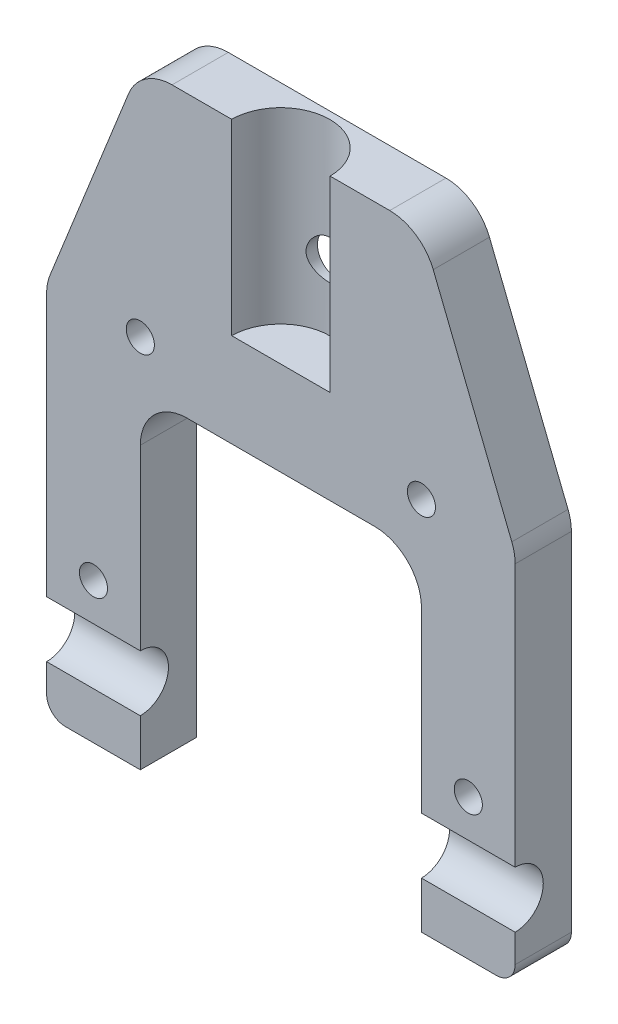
ISO-10303-21;
HEADER;
FILE_DESCRIPTION(('STEP AP214'),'2;1');
FILE_NAME('part.step','',(''),(''),'','','');
FILE_SCHEMA(('AUTOMOTIVE_DESIGN { 1 0 10303 214 1 1 1 1 }'));
ENDSEC;
DATA;
#1=APPLICATION_CONTEXT('core data for automotive mechanical design processes');
#2=APPLICATION_PROTOCOL_DEFINITION('international standard','automotive_design',2000,#1);
#3=PRODUCT_CONTEXT('',#1,'mechanical');
#4=PRODUCT('Part','Part','',(#3));
#5=PRODUCT_RELATED_PRODUCT_CATEGORY('part','',(#4));
#6=PRODUCT_DEFINITION_FORMATION('','',#4);
#7=PRODUCT_DEFINITION_CONTEXT('part definition',#1,'design');
#8=PRODUCT_DEFINITION('design','',#6,#7);
#9=PRODUCT_DEFINITION_SHAPE('','',#8);
#10=(LENGTH_UNIT() NAMED_UNIT(*) SI_UNIT(.MILLI.,.METRE.));
#11=(NAMED_UNIT(*) PLANE_ANGLE_UNIT() SI_UNIT($,.RADIAN.));
#12=(NAMED_UNIT(*) SI_UNIT($,.STERADIAN.) SOLID_ANGLE_UNIT());
#13=UNCERTAINTY_MEASURE_WITH_UNIT(LENGTH_MEASURE(1.E-05),#10,'distance_accuracy_value','');
#14=(GEOMETRIC_REPRESENTATION_CONTEXT(3) GLOBAL_UNCERTAINTY_ASSIGNED_CONTEXT((#13)) GLOBAL_UNIT_ASSIGNED_CONTEXT((#10,
#11,#12)) REPRESENTATION_CONTEXT('',''));
#15=CARTESIAN_POINT('',(0.,0.,0.));
#16=DIRECTION('',(0.,0.,1.));
#17=DIRECTION('',(1.,0.,0.));
#18=AXIS2_PLACEMENT_3D('',#15,#16,#17);
#19=CARTESIAN_POINT('',(5.,39.0370879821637,6.));
#20=DIRECTION('',(0.,0.,-1.));
#21=DIRECTION('',(-1.,0.,0.));
#22=AXIS2_PLACEMENT_3D('',#19,#20,#21);
#23=PLANE('',#22);
#24=CARTESIAN_POINT('',(45.,15.,6.));
#25=DIRECTION('',(0.,0.,1.));
#26=DIRECTION('',(1.,0.,0.));
#27=AXIS2_PLACEMENT_3D('',#24,#25,#26);
#28=CIRCLE('',#27,1.5);
#29=CARTESIAN_POINT('',(46.5,15.,6.));
#30=VERTEX_POINT('',#29);
#31=EDGE_CURVE('E386',#30,#30,#28,.T.);
#32=ORIENTED_EDGE('',*,*,#31,.F.);
#33=EDGE_LOOP('',(#32));
#34=FACE_BOUND('',#33,.T.);
#35=CARTESIAN_POINT('',(40.,40.,6.));
#36=DIRECTION('',(0.,0.,1.));
#37=DIRECTION('',(1.,0.,0.));
#38=AXIS2_PLACEMENT_3D('',#35,#36,#37);
#39=CIRCLE('',#38,1.5);
#40=CARTESIAN_POINT('',(41.5,40.,6.));
#41=VERTEX_POINT('',#40);
#42=EDGE_CURVE('E398',#41,#41,#39,.T.);
#43=ORIENTED_EDGE('',*,*,#42,.F.);
#44=EDGE_LOOP('',(#43));
#45=FACE_BOUND('',#44,.T.);
#46=CARTESIAN_POINT('',(10.,40.,6.));
#47=DIRECTION('',(0.,0.,1.));
#48=DIRECTION('',(1.,0.,0.));
#49=AXIS2_PLACEMENT_3D('',#46,#47,#48);
#50=CIRCLE('',#49,1.5);
#51=CARTESIAN_POINT('',(11.5,40.,6.));
#52=VERTEX_POINT('',#51);
#53=EDGE_CURVE('E404',#52,#52,#50,.T.);
#54=ORIENTED_EDGE('',*,*,#53,.F.);
#55=EDGE_LOOP('',(#54));
#56=FACE_BOUND('',#55,.T.);
#57=CARTESIAN_POINT('',(5.,15.,6.));
#58=DIRECTION('',(0.,0.,1.));
#59=DIRECTION('',(1.,0.,0.));
#60=AXIS2_PLACEMENT_3D('',#57,#58,#59);
#61=CIRCLE('',#60,1.5);
#62=CARTESIAN_POINT('',(6.5,15.,6.));
#63=VERTEX_POINT('',#62);
#64=EDGE_CURVE('E392',#63,#63,#61,.T.);
#65=ORIENTED_EDGE('',*,*,#64,.F.);
#66=EDGE_LOOP('',(#65));
#67=FACE_BOUND('',#66,.T.);
#68=DIRECTION('',(0.,-1.,0.));
#69=VECTOR('',#68,1.);
#70=CARTESIAN_POINT('',(0.,2.00000000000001,6.));
#71=LINE('',#70,#69);
#72=CARTESIAN_POINT('',(0.,39.0370879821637,6.));
#73=VERTEX_POINT('',#72);
#74=CARTESIAN_POINT('',(0.,11.,6.));
#75=VERTEX_POINT('',#74);
#76=EDGE_CURVE('E198',#73,#75,#71,.T.);
#77=ORIENTED_EDGE('',*,*,#76,.T.);
#78=DIRECTION('',(1.,0.,0.));
#79=VECTOR('',#78,1.);
#80=CARTESIAN_POINT('',(0.,11.,6.));
#81=LINE('',#80,#79);
#82=CARTESIAN_POINT('',(10.,11.,6.));
#83=VERTEX_POINT('',#82);
#84=EDGE_CURVE('E184',#75,#83,#81,.T.);
#85=ORIENTED_EDGE('',*,*,#84,.T.);
#86=DIRECTION('',(0.,-1.,0.));
#87=VECTOR('',#86,1.);
#88=CARTESIAN_POINT('',(10.,30.,6.));
#89=LINE('',#88,#87);
#90=CARTESIAN_POINT('',(10.,30.,6.));
#91=VERTEX_POINT('',#90);
#92=EDGE_CURVE('E350',#91,#83,#89,.T.);
#93=ORIENTED_EDGE('',*,*,#92,.F.);
#94=CARTESIAN_POINT('',(15.,30.,6.));
#95=DIRECTION('',(0.,0.,1.));
#96=DIRECTION('',(1.,0.,0.));
#97=AXIS2_PLACEMENT_3D('',#94,#95,#96);
#98=CIRCLE('',#97,5.);
#99=CARTESIAN_POINT('',(15.,35.,6.));
#100=VERTEX_POINT('',#99);
#101=EDGE_CURVE('E351',#100,#91,#98,.T.);
#102=ORIENTED_EDGE('',*,*,#101,.F.);
#103=DIRECTION('',(-1.,0.,0.));
#104=VECTOR('',#103,1.);
#105=CARTESIAN_POINT('',(15.,35.,6.));
#106=LINE('',#105,#104);
#107=CARTESIAN_POINT('',(35.,35.,6.));
#108=VERTEX_POINT('',#107);
#109=EDGE_CURVE('E355',#108,#100,#106,.T.);
#110=ORIENTED_EDGE('',*,*,#109,.F.);
#111=CARTESIAN_POINT('',(35.,30.,6.));
#112=DIRECTION('',(0.,0.,1.));
#113=DIRECTION('',(-1.,0.,0.));
#114=AXIS2_PLACEMENT_3D('',#111,#112,#113);
#115=CIRCLE('',#114,5.);
#116=CARTESIAN_POINT('',(40.,30.,6.));
#117=VERTEX_POINT('',#116);
#118=EDGE_CURVE('E477',#117,#108,#115,.T.);
#119=ORIENTED_EDGE('',*,*,#118,.F.);
#120=DIRECTION('',(0.,1.,0.));
#121=VECTOR('',#120,1.);
#122=CARTESIAN_POINT('',(40.,30.,6.));
#123=LINE('',#122,#121);
#124=CARTESIAN_POINT('',(40.,11.,6.));
#125=VERTEX_POINT('',#124);
#126=EDGE_CURVE('E474',#125,#117,#123,.T.);
#127=ORIENTED_EDGE('',*,*,#126,.F.);
#128=CARTESIAN_POINT('',(50.,11.,6.));
#129=VERTEX_POINT('',#128);
#130=EDGE_CURVE('E41',#125,#129,#81,.T.);
#131=ORIENTED_EDGE('',*,*,#130,.T.);
#132=DIRECTION('',(0.,1.,0.));
#133=VECTOR('',#132,1.);
#134=CARTESIAN_POINT('',(50.,39.0370879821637,6.));
#135=LINE('',#134,#133);
#136=CARTESIAN_POINT('',(50.,39.0370879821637,6.));
#137=VERTEX_POINT('',#136);
#138=EDGE_CURVE('E219',#129,#137,#135,.T.);
#139=ORIENTED_EDGE('',*,*,#138,.T.);
#140=CARTESIAN_POINT('',(45.,39.0370879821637,6.));
#141=DIRECTION('',(0.,0.,1.));
#142=DIRECTION('',(-1.,0.,0.));
#143=AXIS2_PLACEMENT_3D('',#140,#141,#142);
#144=CIRCLE('',#143,5.);
#145=CARTESIAN_POINT('',(49.6423834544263,40.8940413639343,6.));
#146=VERTEX_POINT('',#145);
#147=EDGE_CURVE('E223',#137,#146,#144,.T.);
#148=ORIENTED_EDGE('',*,*,#147,.T.);
#149=DIRECTION('',(-0.371390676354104,0.928476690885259,0.));
#150=VECTOR('',#149,1.);
#151=CARTESIAN_POINT('',(41.2572186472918,61.8569533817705,6.));
#152=LINE('',#151,#150);
#153=CARTESIAN_POINT('',(41.2572186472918,61.8569533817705,6.));
#154=VERTEX_POINT('',#153);
#155=EDGE_CURVE('E225',#146,#154,#152,.T.);
#156=ORIENTED_EDGE('',*,*,#155,.T.);
#157=CARTESIAN_POINT('',(36.6148351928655,60.,6.));
#158=DIRECTION('',(0.,0.,1.));
#159=DIRECTION('',(-1.,0.,0.));
#160=AXIS2_PLACEMENT_3D('',#157,#158,#159);
#161=CIRCLE('',#160,5.);
#162=CARTESIAN_POINT('',(36.6148351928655,65.,6.));
#163=VERTEX_POINT('',#162);
#164=EDGE_CURVE('E227',#154,#163,#161,.T.);
#165=ORIENTED_EDGE('',*,*,#164,.T.);
#166=DIRECTION('',(-1.,0.,0.));
#167=VECTOR('',#166,1.);
#168=CARTESIAN_POINT('',(13.3851648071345,65.,6.));
#169=LINE('',#168,#167);
#170=CARTESIAN_POINT('',(30.2499348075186,65.,6.));
#171=VERTEX_POINT('',#170);
#172=EDGE_CURVE('E230',#163,#171,#169,.T.);
#173=ORIENTED_EDGE('',*,*,#172,.T.);
#174=DIRECTION('',(0.,1.,0.));
#175=VECTOR('',#174,1.);
#176=CARTESIAN_POINT('',(30.2499348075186,45.,6.));
#177=LINE('',#176,#175);
#178=CARTESIAN_POINT('',(30.2499348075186,45.,6.));
#179=VERTEX_POINT('',#178);
#180=EDGE_CURVE('E280',#171,#179,#177,.F.);
#181=ORIENTED_EDGE('',*,*,#180,.T.);
#182=DIRECTION('',(1.,0.,0.));
#183=VECTOR('',#182,1.);
#184=CARTESIAN_POINT('',(5.,45.,6.));
#185=LINE('',#184,#183);
#186=CARTESIAN_POINT('',(19.7500651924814,45.,6.));
#187=VERTEX_POINT('',#186);
#188=EDGE_CURVE('E272',#187,#179,#185,.T.);
#189=ORIENTED_EDGE('',*,*,#188,.F.);
#190=DIRECTION('',(0.,1.,0.));
#191=VECTOR('',#190,1.);
#192=CARTESIAN_POINT('',(19.7500651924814,45.,6.));
#193=LINE('',#192,#191);
#194=CARTESIAN_POINT('',(19.7500651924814,65.,6.));
#195=VERTEX_POINT('',#194);
#196=EDGE_CURVE('E377',#187,#195,#193,.T.);
#197=ORIENTED_EDGE('',*,*,#196,.T.);
#198=CARTESIAN_POINT('',(13.3851648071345,65.,6.));
#199=VERTEX_POINT('',#198);
#200=EDGE_CURVE('E229',#195,#199,#169,.T.);
#201=ORIENTED_EDGE('',*,*,#200,.T.);
#202=CARTESIAN_POINT('',(13.3851648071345,60.,6.));
#203=DIRECTION('',(0.,0.,1.));
#204=DIRECTION('',(-1.,0.,0.));
#205=AXIS2_PLACEMENT_3D('',#202,#203,#204);
#206=CIRCLE('',#205,5.);
#207=CARTESIAN_POINT('',(8.7427813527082,61.8569533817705,6.));
#208=VERTEX_POINT('',#207);
#209=EDGE_CURVE('E233',#199,#208,#206,.T.);
#210=ORIENTED_EDGE('',*,*,#209,.T.);
#211=DIRECTION('',(-0.371390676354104,-0.928476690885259,0.));
#212=VECTOR('',#211,1.);
#213=CARTESIAN_POINT('',(0.35761654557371,40.8940413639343,6.));
#214=LINE('',#213,#212);
#215=CARTESIAN_POINT('',(0.35761654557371,40.8940413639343,6.));
#216=VERTEX_POINT('',#215);
#217=EDGE_CURVE('E235',#208,#216,#214,.T.);
#218=ORIENTED_EDGE('',*,*,#217,.T.);
#219=CARTESIAN_POINT('',(5.,39.0370879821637,6.));
#220=DIRECTION('',(0.,0.,1.));
#221=DIRECTION('',(-1.,0.,0.));
#222=AXIS2_PLACEMENT_3D('',#219,#220,#221);
#223=CIRCLE('',#222,5.);
#224=EDGE_CURVE('E205',#216,#73,#223,.T.);
#225=ORIENTED_EDGE('',*,*,#224,.T.);
#226=EDGE_LOOP('',(#77,#85,#93,#102,#110,#119,#127,#131,#139,#148,#156,#165,#173,#181,#189,#197,
#201,#210,#218,#225));
#227=FACE_BOUND('',#226,.T.);
#228=ADVANCED_FACE('F26',(#34,#45,#56,#67,#227),#23,.F.);
#229=CARTESIAN_POINT('',(50.,2.00000000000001,6.));
#230=VERTEX_POINT('',#229);
#231=CARTESIAN_POINT('',(50.,5.,6.));
#232=VERTEX_POINT('',#231);
#233=EDGE_CURVE('E220',#230,#232,#135,.T.);
#234=ORIENTED_EDGE('',*,*,#233,.T.);
#235=DIRECTION('',(1.,0.,0.));
#236=VECTOR('',#235,1.);
#237=CARTESIAN_POINT('',(0.,5.,6.));
#238=LINE('',#237,#236);
#239=CARTESIAN_POINT('',(40.,5.,6.));
#240=VERTEX_POINT('',#239);
#241=EDGE_CURVE('E478',#232,#240,#238,.F.);
#242=ORIENTED_EDGE('',*,*,#241,.T.);
#243=CARTESIAN_POINT('',(40.,0.,6.));
#244=VERTEX_POINT('',#243);
#245=EDGE_CURVE('E475',#244,#240,#123,.T.);
#246=ORIENTED_EDGE('',*,*,#245,.F.);
#247=DIRECTION('',(1.,0.,0.));
#248=VECTOR('',#247,1.);
#249=CARTESIAN_POINT('',(48.,0.,6.));
#250=LINE('',#249,#248);
#251=CARTESIAN_POINT('',(48.,0.,6.));
#252=VERTEX_POINT('',#251);
#253=EDGE_CURVE('E209',#244,#252,#250,.T.);
#254=ORIENTED_EDGE('',*,*,#253,.T.);
#255=CARTESIAN_POINT('',(48.,2.,6.));
#256=DIRECTION('',(0.,0.,1.));
#257=DIRECTION('',(-1.,0.,0.));
#258=AXIS2_PLACEMENT_3D('',#255,#256,#257);
#259=CIRCLE('',#258,2.);
#260=EDGE_CURVE('E217',#252,#230,#259,.T.);
#261=ORIENTED_EDGE('',*,*,#260,.T.);
#262=EDGE_LOOP('',(#234,#242,#246,#254,#261));
#263=FACE_BOUND('',#262,.T.);
#264=ADVANCED_FACE('F321',(#263),#23,.F.);
#265=CARTESIAN_POINT('',(48.,0.,6.));
#266=DIRECTION('',(0.,1.,0.));
#267=DIRECTION('',(0.,0.,1.));
#268=AXIS2_PLACEMENT_3D('',#265,#266,#267);
#269=PLANE('',#268);
#270=ORIENTED_EDGE('',*,*,#253,.F.);
#271=DIRECTION('',(0.,0.,-1.));
#272=VECTOR('',#271,1.);
#273=CARTESIAN_POINT('',(40.,0.,6.));
#274=LINE('',#273,#272);
#275=CARTESIAN_POINT('',(40.,0.,0.));
#276=VERTEX_POINT('',#275);
#277=EDGE_CURVE('E452',#244,#276,#274,.T.);
#278=ORIENTED_EDGE('',*,*,#277,.T.);
#279=DIRECTION('',(1.,0.,0.));
#280=VECTOR('',#279,1.);
#281=CARTESIAN_POINT('',(48.,0.,0.));
#282=LINE('',#281,#280);
#283=CARTESIAN_POINT('',(48.,0.,0.));
#284=VERTEX_POINT('',#283);
#285=EDGE_CURVE('E414',#276,#284,#282,.T.);
#286=ORIENTED_EDGE('',*,*,#285,.T.);
#287=DIRECTION('',(0.,0.,-1.));
#288=VECTOR('',#287,1.);
#289=CARTESIAN_POINT('',(48.,0.,6.));
#290=LINE('',#289,#288);
#291=EDGE_CURVE('E261',#252,#284,#290,.T.);
#292=ORIENTED_EDGE('',*,*,#291,.F.);
#293=EDGE_LOOP('',(#270,#278,#286,#292));
#294=FACE_BOUND('',#293,.T.);
#295=ADVANCED_FACE('F328',(#294),#269,.F.);
#296=CARTESIAN_POINT('',(10.,5.,6.));
#297=VERTEX_POINT('',#296);
#298=CARTESIAN_POINT('',(10.,0.,6.));
#299=VERTEX_POINT('',#298);
#300=EDGE_CURVE('E347',#297,#299,#89,.T.);
#301=ORIENTED_EDGE('',*,*,#300,.F.);
#302=CARTESIAN_POINT('',(0.,5.,6.));
#303=VERTEX_POINT('',#302);
#304=EDGE_CURVE('E49',#297,#303,#238,.F.);
#305=ORIENTED_EDGE('',*,*,#304,.T.);
#306=CARTESIAN_POINT('',(0.,2.00000000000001,6.));
#307=VERTEX_POINT('',#306);
#308=EDGE_CURVE('E201',#303,#307,#71,.T.);
#309=ORIENTED_EDGE('',*,*,#308,.T.);
#310=CARTESIAN_POINT('',(2.,2.,6.));
#311=DIRECTION('',(0.,0.,1.));
#312=DIRECTION('',(1.,0.,0.));
#313=AXIS2_PLACEMENT_3D('',#310,#311,#312);
#314=CIRCLE('',#313,2.);
#315=CARTESIAN_POINT('',(2.00000000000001,0.,6.));
#316=VERTEX_POINT('',#315);
#317=EDGE_CURVE('E207',#307,#316,#314,.T.);
#318=ORIENTED_EDGE('',*,*,#317,.T.);
#319=EDGE_CURVE('E214',#316,#299,#250,.T.);
#320=ORIENTED_EDGE('',*,*,#319,.T.);
#321=EDGE_LOOP('',(#301,#305,#309,#318,#320));
#322=FACE_BOUND('',#321,.T.);
#323=ADVANCED_FACE('F324',(#322),#23,.F.);
#324=CARTESIAN_POINT('',(5.,39.0370879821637,0.));
#325=DIRECTION('',(0.,0.,-1.));
#326=DIRECTION('',(-1.,0.,0.));
#327=AXIS2_PLACEMENT_3D('',#324,#325,#326);
#328=PLANE('',#327);
#329=DIRECTION('',(0.,-1.,0.));
#330=VECTOR('',#329,1.);
#331=CARTESIAN_POINT('',(40.,39.0370879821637,0.));
#332=LINE('',#331,#330);
#333=CARTESIAN_POINT('',(40.,30.,0.));
#334=VERTEX_POINT('',#333);
#335=EDGE_CURVE('E369',#334,#276,#332,.T.);
#336=ORIENTED_EDGE('',*,*,#335,.F.);
#337=CARTESIAN_POINT('',(35.,30.,0.));
#338=DIRECTION('',(0.,0.,-1.));
#339=DIRECTION('',(-1.,0.,0.));
#340=AXIS2_PLACEMENT_3D('',#337,#338,#339);
#341=CIRCLE('',#340,5.);
#342=CARTESIAN_POINT('',(35.,35.,0.));
#343=VERTEX_POINT('',#342);
#344=EDGE_CURVE('E454',#343,#334,#341,.T.);
#345=ORIENTED_EDGE('',*,*,#344,.F.);
#346=DIRECTION('',(1.,0.,0.));
#347=VECTOR('',#346,1.);
#348=CARTESIAN_POINT('',(5.,35.,0.));
#349=LINE('',#348,#347);
#350=CARTESIAN_POINT('',(15.,35.,0.));
#351=VERTEX_POINT('',#350);
#352=EDGE_CURVE('E458',#351,#343,#349,.T.);
#353=ORIENTED_EDGE('',*,*,#352,.F.);
#354=CARTESIAN_POINT('',(15.,30.,0.));
#355=DIRECTION('',(0.,0.,-1.));
#356=DIRECTION('',(-1.,0.,0.));
#357=AXIS2_PLACEMENT_3D('',#354,#355,#356);
#358=CIRCLE('',#357,5.);
#359=CARTESIAN_POINT('',(10.,30.,0.));
#360=VERTEX_POINT('',#359);
#361=EDGE_CURVE('E34',#360,#351,#358,.T.);
#362=ORIENTED_EDGE('',*,*,#361,.F.);
#363=DIRECTION('',(0.,1.,0.));
#364=VECTOR('',#363,1.);
#365=CARTESIAN_POINT('',(10.,39.0370879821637,0.));
#366=LINE('',#365,#364);
#367=CARTESIAN_POINT('',(10.,0.,0.));
#368=VERTEX_POINT('',#367);
#369=EDGE_CURVE('E361',#368,#360,#366,.T.);
#370=ORIENTED_EDGE('',*,*,#369,.F.);
#371=CARTESIAN_POINT('',(2.00000000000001,0.,0.));
#372=VERTEX_POINT('',#371);
#373=EDGE_CURVE('E415',#372,#368,#282,.T.);
#374=ORIENTED_EDGE('',*,*,#373,.F.);
#375=CARTESIAN_POINT('',(2.,2.,0.));
#376=DIRECTION('',(0.,0.,1.));
#377=DIRECTION('',(1.,0.,0.));
#378=AXIS2_PLACEMENT_3D('',#375,#376,#377);
#379=CIRCLE('',#378,2.);
#380=CARTESIAN_POINT('',(0.,2.00000000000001,0.));
#381=VERTEX_POINT('',#380);
#382=EDGE_CURVE('E412',#381,#372,#379,.T.);
#383=ORIENTED_EDGE('',*,*,#382,.F.);
#384=DIRECTION('',(0.,-1.,0.));
#385=VECTOR('',#384,1.);
#386=CARTESIAN_POINT('',(0.,2.00000000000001,0.));
#387=LINE('',#386,#385);
#388=CARTESIAN_POINT('',(0.,39.0370879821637,0.));
#389=VERTEX_POINT('',#388);
#390=EDGE_CURVE('E410',#389,#381,#387,.T.);
#391=ORIENTED_EDGE('',*,*,#390,.F.);
#392=CARTESIAN_POINT('',(5.,39.0370879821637,0.));
#393=DIRECTION('',(0.,0.,1.));
#394=DIRECTION('',(-1.,0.,0.));
#395=AXIS2_PLACEMENT_3D('',#392,#393,#394);
#396=CIRCLE('',#395,5.);
#397=CARTESIAN_POINT('',(0.35761654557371,40.8940413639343,0.));
#398=VERTEX_POINT('',#397);
#399=EDGE_CURVE('E407',#398,#389,#396,.T.);
#400=ORIENTED_EDGE('',*,*,#399,.F.);
#401=DIRECTION('',(-0.371390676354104,-0.928476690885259,0.));
#402=VECTOR('',#401,1.);
#403=CARTESIAN_POINT('',(0.35761654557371,40.8940413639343,0.));
#404=LINE('',#403,#402);
#405=CARTESIAN_POINT('',(8.7427813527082,61.8569533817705,0.));
#406=VERTEX_POINT('',#405);
#407=EDGE_CURVE('E431',#406,#398,#404,.T.);
#408=ORIENTED_EDGE('',*,*,#407,.F.);
#409=CARTESIAN_POINT('',(13.3851648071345,60.,0.));
#410=DIRECTION('',(0.,0.,1.));
#411=DIRECTION('',(-1.,0.,0.));
#412=AXIS2_PLACEMENT_3D('',#409,#410,#411);
#413=CIRCLE('',#412,5.);
#414=CARTESIAN_POINT('',(13.3851648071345,65.,0.));
#415=VERTEX_POINT('',#414);
#416=EDGE_CURVE('E430',#415,#406,#413,.T.);
#417=ORIENTED_EDGE('',*,*,#416,.F.);
#418=DIRECTION('',(-1.,0.,0.));
#419=VECTOR('',#418,1.);
#420=CARTESIAN_POINT('',(13.3851648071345,65.,0.));
#421=LINE('',#420,#419);
#422=CARTESIAN_POINT('',(36.6148351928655,65.,0.));
#423=VERTEX_POINT('',#422);
#424=EDGE_CURVE('E428',#423,#415,#421,.T.);
#425=ORIENTED_EDGE('',*,*,#424,.F.);
#426=CARTESIAN_POINT('',(36.6148351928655,60.,0.));
#427=DIRECTION('',(0.,0.,1.));
#428=DIRECTION('',(-1.,0.,0.));
#429=AXIS2_PLACEMENT_3D('',#426,#427,#428);
#430=CIRCLE('',#429,5.);
#431=CARTESIAN_POINT('',(41.2572186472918,61.8569533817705,0.));
#432=VERTEX_POINT('',#431);
#433=EDGE_CURVE('E426',#432,#423,#430,.T.);
#434=ORIENTED_EDGE('',*,*,#433,.F.);
#435=DIRECTION('',(-0.371390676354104,0.928476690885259,0.));
#436=VECTOR('',#435,1.);
#437=CARTESIAN_POINT('',(41.2572186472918,61.8569533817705,0.));
#438=LINE('',#437,#436);
#439=CARTESIAN_POINT('',(49.6423834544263,40.8940413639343,0.));
#440=VERTEX_POINT('',#439);
#441=EDGE_CURVE('E424',#440,#432,#438,.T.);
#442=ORIENTED_EDGE('',*,*,#441,.F.);
#443=CARTESIAN_POINT('',(45.,39.0370879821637,0.));
#444=DIRECTION('',(0.,0.,1.));
#445=DIRECTION('',(-1.,0.,0.));
#446=AXIS2_PLACEMENT_3D('',#443,#444,#445);
#447=CIRCLE('',#446,5.);
#448=CARTESIAN_POINT('',(50.,39.0370879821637,0.));
#449=VERTEX_POINT('',#448);
#450=EDGE_CURVE('E422',#449,#440,#447,.T.);
#451=ORIENTED_EDGE('',*,*,#450,.F.);
#452=DIRECTION('',(0.,1.,0.));
#453=VECTOR('',#452,1.);
#454=CARTESIAN_POINT('',(50.,39.0370879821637,0.));
#455=LINE('',#454,#453);
#456=CARTESIAN_POINT('',(50.,2.00000000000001,0.));
#457=VERTEX_POINT('',#456);
#458=EDGE_CURVE('E420',#457,#449,#455,.T.);
#459=ORIENTED_EDGE('',*,*,#458,.F.);
#460=CARTESIAN_POINT('',(48.,2.,0.));
#461=DIRECTION('',(0.,0.,1.));
#462=DIRECTION('',(-1.,0.,0.));
#463=AXIS2_PLACEMENT_3D('',#460,#461,#462);
#464=CIRCLE('',#463,2.);
#465=EDGE_CURVE('E418',#284,#457,#464,.T.);
#466=ORIENTED_EDGE('',*,*,#465,.F.);
#467=ORIENTED_EDGE('',*,*,#285,.F.);
#468=EDGE_LOOP('',(#336,#345,#353,#362,#370,#374,#383,#391,#400,#408,#417,#425,#434,#442,#451,
#459,#466,#467));
#469=FACE_BOUND('',#468,.T.);
#470=CARTESIAN_POINT('',(45.,15.,0.));
#471=DIRECTION('',(0.,0.,1.));
#472=DIRECTION('',(1.,0.,0.));
#473=AXIS2_PLACEMENT_3D('',#470,#471,#472);
#474=CIRCLE('',#473,1.5);
#475=CARTESIAN_POINT('',(46.5,15.,0.));
#476=VERTEX_POINT('',#475);
#477=EDGE_CURVE('E383',#476,#476,#474,.T.);
#478=ORIENTED_EDGE('',*,*,#477,.T.);
#479=EDGE_LOOP('',(#478));
#480=FACE_BOUND('',#479,.T.);
#481=CARTESIAN_POINT('',(40.,40.,0.));
#482=DIRECTION('',(0.,0.,1.));
#483=DIRECTION('',(1.,0.,0.));
#484=AXIS2_PLACEMENT_3D('',#481,#482,#483);
#485=CIRCLE('',#484,1.5);
#486=CARTESIAN_POINT('',(41.5,40.,0.));
#487=VERTEX_POINT('',#486);
#488=EDGE_CURVE('E395',#487,#487,#485,.T.);
#489=ORIENTED_EDGE('',*,*,#488,.T.);
#490=EDGE_LOOP('',(#489));
#491=FACE_BOUND('',#490,.T.);
#492=CARTESIAN_POINT('',(10.,40.,0.));
#493=DIRECTION('',(0.,0.,1.));
#494=DIRECTION('',(1.,0.,0.));
#495=AXIS2_PLACEMENT_3D('',#492,#493,#494);
#496=CIRCLE('',#495,1.5);
#497=CARTESIAN_POINT('',(11.5,40.,0.));
#498=VERTEX_POINT('',#497);
#499=EDGE_CURVE('E401',#498,#498,#496,.T.);
#500=ORIENTED_EDGE('',*,*,#499,.T.);
#501=EDGE_LOOP('',(#500));
#502=FACE_BOUND('',#501,.T.);
#503=CARTESIAN_POINT('',(5.,15.,0.));
#504=DIRECTION('',(0.,0.,1.));
#505=DIRECTION('',(1.,0.,0.));
#506=AXIS2_PLACEMENT_3D('',#503,#504,#505);
#507=CIRCLE('',#506,1.5);
#508=CARTESIAN_POINT('',(6.5,15.,0.));
#509=VERTEX_POINT('',#508);
#510=EDGE_CURVE('E389',#509,#509,#507,.T.);
#511=ORIENTED_EDGE('',*,*,#510,.T.);
#512=EDGE_LOOP('',(#511));
#513=FACE_BOUND('',#512,.T.);
#514=CARTESIAN_POINT('',(25.,52.,0.));
#515=DIRECTION('',(0.,0.,1.));
#516=DIRECTION('',(1.,0.,0.));
#517=AXIS2_PLACEMENT_3D('',#514,#515,#516);
#518=CIRCLE('',#517,2.1);
#519=CARTESIAN_POINT('',(27.1,52.,0.));
#520=VERTEX_POINT('',#519);
#521=EDGE_CURVE('E380',#520,#520,#518,.T.);
#522=ORIENTED_EDGE('',*,*,#521,.T.);
#523=EDGE_LOOP('',(#522));
#524=FACE_BOUND('',#523,.T.);
#525=ADVANCED_FACE('F335',(#469,#480,#491,#502,#513,#524),#328,.T.);
#526=CARTESIAN_POINT('',(5.,39.0370879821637,6.));
#527=DIRECTION('',(0.,0.,-1.));
#528=DIRECTION('',(-1.,0.,0.));
#529=AXIS2_PLACEMENT_3D('',#526,#527,#528);
#530=CYLINDRICAL_SURFACE('',#529,5.);
#531=ORIENTED_EDGE('',*,*,#399,.T.);
#532=DIRECTION('',(0.,0.,-1.));
#533=VECTOR('',#532,1.);
#534=CARTESIAN_POINT('',(0.,39.0370879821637,6.));
#535=LINE('',#534,#533);
#536=EDGE_CURVE('E270',#73,#389,#535,.T.);
#537=ORIENTED_EDGE('',*,*,#536,.F.);
#538=ORIENTED_EDGE('',*,*,#224,.F.);
#539=DIRECTION('',(0.,0.,-1.));
#540=VECTOR('',#539,1.);
#541=CARTESIAN_POINT('',(0.35761654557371,40.8940413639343,6.));
#542=LINE('',#541,#540);
#543=EDGE_CURVE('E237',#216,#398,#542,.T.);
#544=ORIENTED_EDGE('',*,*,#543,.T.);
#545=EDGE_LOOP('',(#531,#537,#538,#544));
#546=FACE_BOUND('',#545,.T.);
#547=ADVANCED_FACE('F28',(#546),#530,.T.);
#548=CARTESIAN_POINT('',(0.,2.00000000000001,6.));
#549=DIRECTION('',(1.,0.,0.));
#550=DIRECTION('',(0.,0.,-1.));
#551=AXIS2_PLACEMENT_3D('',#548,#549,#550);
#552=PLANE('',#551);
#553=ORIENTED_EDGE('',*,*,#308,.F.);
#554=CARTESIAN_POINT('',(0.,8.,6.));
#555=DIRECTION('',(1.,0.,0.));
#556=DIRECTION('',(0.,0.,-1.));
#557=AXIS2_PLACEMENT_3D('',#554,#555,#556);
#558=CIRCLE('',#557,3.);
#559=EDGE_CURVE('E187',#303,#75,#558,.T.);
#560=ORIENTED_EDGE('',*,*,#559,.T.);
#561=ORIENTED_EDGE('',*,*,#76,.F.);
#562=ORIENTED_EDGE('',*,*,#536,.T.);
#563=ORIENTED_EDGE('',*,*,#390,.T.);
#564=DIRECTION('',(0.,0.,-1.));
#565=VECTOR('',#564,1.);
#566=CARTESIAN_POINT('',(0.,2.00000000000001,6.));
#567=LINE('',#566,#565);
#568=EDGE_CURVE('E267',#307,#381,#567,.T.);
#569=ORIENTED_EDGE('',*,*,#568,.F.);
#570=EDGE_LOOP('',(#553,#560,#561,#562,#563,#569));
#571=FACE_BOUND('',#570,.T.);
#572=ADVANCED_FACE('F196',(#571),#552,.F.);
#573=CARTESIAN_POINT('',(2.,2.,6.));
#574=DIRECTION('',(0.,0.,-1.));
#575=DIRECTION('',(-1.,0.,0.));
#576=AXIS2_PLACEMENT_3D('',#573,#574,#575);
#577=CYLINDRICAL_SURFACE('',#576,2.);
#578=ORIENTED_EDGE('',*,*,#382,.T.);
#579=DIRECTION('',(0.,0.,-1.));
#580=VECTOR('',#579,1.);
#581=CARTESIAN_POINT('',(2.00000000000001,0.,6.));
#582=LINE('',#581,#580);
#583=EDGE_CURVE('E264',#316,#372,#582,.T.);
#584=ORIENTED_EDGE('',*,*,#583,.F.);
#585=ORIENTED_EDGE('',*,*,#317,.F.);
#586=ORIENTED_EDGE('',*,*,#568,.T.);
#587=EDGE_LOOP('',(#578,#584,#585,#586));
#588=FACE_BOUND('',#587,.T.);
#589=ADVANCED_FACE('F447',(#588),#577,.T.);
#590=ORIENTED_EDGE('',*,*,#373,.T.);
#591=DIRECTION('',(0.,0.,1.));
#592=VECTOR('',#591,1.);
#593=CARTESIAN_POINT('',(10.,0.,6.));
#594=LINE('',#593,#592);
#595=EDGE_CURVE('E450',#368,#299,#594,.T.);
#596=ORIENTED_EDGE('',*,*,#595,.T.);
#597=ORIENTED_EDGE('',*,*,#319,.F.);
#598=ORIENTED_EDGE('',*,*,#583,.T.);
#599=EDGE_LOOP('',(#590,#596,#597,#598));
#600=FACE_BOUND('',#599,.T.);
#601=ADVANCED_FACE('F345',(#600),#269,.F.);
#602=CARTESIAN_POINT('',(48.,2.,6.));
#603=DIRECTION('',(0.,0.,-1.));
#604=DIRECTION('',(-1.,0.,0.));
#605=AXIS2_PLACEMENT_3D('',#602,#603,#604);
#606=CYLINDRICAL_SURFACE('',#605,2.);
#607=ORIENTED_EDGE('',*,*,#465,.T.);
#608=DIRECTION('',(0.,0.,-1.));
#609=VECTOR('',#608,1.);
#610=CARTESIAN_POINT('',(50.,2.00000000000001,6.));
#611=LINE('',#610,#609);
#612=EDGE_CURVE('E258',#230,#457,#611,.T.);
#613=ORIENTED_EDGE('',*,*,#612,.F.);
#614=ORIENTED_EDGE('',*,*,#260,.F.);
#615=ORIENTED_EDGE('',*,*,#291,.T.);
#616=EDGE_LOOP('',(#607,#613,#614,#615));
#617=FACE_BOUND('',#616,.T.);
#618=ADVANCED_FACE('F522',(#617),#606,.T.);
#619=CARTESIAN_POINT('',(50.,39.0370879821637,6.));
#620=DIRECTION('',(-1.,0.,0.));
#621=DIRECTION('',(0.,0.,1.));
#622=AXIS2_PLACEMENT_3D('',#619,#620,#621);
#623=PLANE('',#622);
#624=ORIENTED_EDGE('',*,*,#138,.F.);
#625=CARTESIAN_POINT('',(50.,8.,6.));
#626=DIRECTION('',(1.,0.,0.));
#627=DIRECTION('',(0.,0.,-1.));
#628=AXIS2_PLACEMENT_3D('',#625,#626,#627);
#629=CIRCLE('',#628,3.);
#630=EDGE_CURVE('E202',#232,#129,#629,.T.);
#631=ORIENTED_EDGE('',*,*,#630,.F.);
#632=ORIENTED_EDGE('',*,*,#233,.F.);
#633=ORIENTED_EDGE('',*,*,#612,.T.);
#634=ORIENTED_EDGE('',*,*,#458,.T.);
#635=DIRECTION('',(0.,0.,-1.));
#636=VECTOR('',#635,1.);
#637=CARTESIAN_POINT('',(50.,39.0370879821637,6.));
#638=LINE('',#637,#636);
#639=EDGE_CURVE('E255',#137,#449,#638,.T.);
#640=ORIENTED_EDGE('',*,*,#639,.F.);
#641=EDGE_LOOP('',(#624,#631,#632,#633,#634,#640));
#642=FACE_BOUND('',#641,.T.);
#643=ADVANCED_FACE('F489',(#642),#623,.F.);
#644=CARTESIAN_POINT('',(45.,39.0370879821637,6.));
#645=DIRECTION('',(0.,0.,-1.));
#646=DIRECTION('',(-1.,0.,0.));
#647=AXIS2_PLACEMENT_3D('',#644,#645,#646);
#648=CYLINDRICAL_SURFACE('',#647,5.);
#649=ORIENTED_EDGE('',*,*,#450,.T.);
#650=DIRECTION('',(0.,0.,-1.));
#651=VECTOR('',#650,1.);
#652=CARTESIAN_POINT('',(49.6423834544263,40.8940413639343,6.));
#653=LINE('',#652,#651);
#654=EDGE_CURVE('E252',#146,#440,#653,.T.);
#655=ORIENTED_EDGE('',*,*,#654,.F.);
#656=ORIENTED_EDGE('',*,*,#147,.F.);
#657=ORIENTED_EDGE('',*,*,#639,.T.);
#658=EDGE_LOOP('',(#649,#655,#656,#657));
#659=FACE_BOUND('',#658,.T.);
#660=ADVANCED_FACE('F495',(#659),#648,.T.);
#661=CARTESIAN_POINT('',(41.2572186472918,61.8569533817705,6.));
#662=DIRECTION('',(-0.928476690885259,-0.371390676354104,0.));
#663=DIRECTION('',(0.371390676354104,-0.928476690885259,0.));
#664=AXIS2_PLACEMENT_3D('',#661,#662,#663);
#665=PLANE('',#664);
#666=ORIENTED_EDGE('',*,*,#441,.T.);
#667=DIRECTION('',(0.,0.,-1.));
#668=VECTOR('',#667,1.);
#669=CARTESIAN_POINT('',(41.2572186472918,61.8569533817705,6.));
#670=LINE('',#669,#668);
#671=EDGE_CURVE('E249',#154,#432,#670,.T.);
#672=ORIENTED_EDGE('',*,*,#671,.F.);
#673=ORIENTED_EDGE('',*,*,#155,.F.);
#674=ORIENTED_EDGE('',*,*,#654,.T.);
#675=EDGE_LOOP('',(#666,#672,#673,#674));
#676=FACE_BOUND('',#675,.T.);
#677=ADVANCED_FACE('F501',(#676),#665,.F.);
#678=CARTESIAN_POINT('',(36.6148351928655,60.,6.));
#679=DIRECTION('',(0.,0.,-1.));
#680=DIRECTION('',(-1.,0.,0.));
#681=AXIS2_PLACEMENT_3D('',#678,#679,#680);
#682=CYLINDRICAL_SURFACE('',#681,5.);
#683=ORIENTED_EDGE('',*,*,#433,.T.);
#684=DIRECTION('',(0.,0.,-1.));
#685=VECTOR('',#684,1.);
#686=CARTESIAN_POINT('',(36.6148351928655,65.,6.));
#687=LINE('',#686,#685);
#688=EDGE_CURVE('E246',#163,#423,#687,.T.);
#689=ORIENTED_EDGE('',*,*,#688,.F.);
#690=ORIENTED_EDGE('',*,*,#164,.F.);
#691=ORIENTED_EDGE('',*,*,#671,.T.);
#692=EDGE_LOOP('',(#683,#689,#690,#691));
#693=FACE_BOUND('',#692,.T.);
#694=ADVANCED_FACE('F505',(#693),#682,.T.);
#695=CARTESIAN_POINT('',(13.3851648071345,65.,6.));
#696=DIRECTION('',(0.,-1.,0.));
#697=DIRECTION('',(0.,0.,-1.));
#698=AXIS2_PLACEMENT_3D('',#695,#696,#697);
#699=PLANE('',#698);
#700=ORIENTED_EDGE('',*,*,#200,.F.);
#701=CARTESIAN_POINT('',(25.,65.,6.02616327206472));
#702=DIRECTION('',(0.,1.,0.));
#703=DIRECTION('',(0.,0.,1.));
#704=AXIS2_PLACEMENT_3D('',#701,#702,#703);
#705=CIRCLE('',#704,5.25);
#706=EDGE_CURVE('E371',#171,#195,#705,.T.);
#707=ORIENTED_EDGE('',*,*,#706,.F.);
#708=ORIENTED_EDGE('',*,*,#172,.F.);
#709=ORIENTED_EDGE('',*,*,#688,.T.);
#710=ORIENTED_EDGE('',*,*,#424,.T.);
#711=DIRECTION('',(0.,0.,-1.));
#712=VECTOR('',#711,1.);
#713=CARTESIAN_POINT('',(13.3851648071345,65.,6.));
#714=LINE('',#713,#712);
#715=EDGE_CURVE('E243',#199,#415,#714,.T.);
#716=ORIENTED_EDGE('',*,*,#715,.F.);
#717=EDGE_LOOP('',(#700,#707,#708,#709,#710,#716));
#718=FACE_BOUND('',#717,.T.);
#719=ADVANCED_FACE('F511',(#718),#699,.F.);
#720=CARTESIAN_POINT('',(13.3851648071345,60.,6.));
#721=DIRECTION('',(0.,0.,-1.));
#722=DIRECTION('',(-1.,0.,0.));
#723=AXIS2_PLACEMENT_3D('',#720,#721,#722);
#724=CYLINDRICAL_SURFACE('',#723,5.);
#725=ORIENTED_EDGE('',*,*,#416,.T.);
#726=DIRECTION('',(0.,0.,-1.));
#727=VECTOR('',#726,1.);
#728=CARTESIAN_POINT('',(8.7427813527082,61.8569533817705,6.));
#729=LINE('',#728,#727);
#730=EDGE_CURVE('E240',#208,#406,#729,.T.);
#731=ORIENTED_EDGE('',*,*,#730,.F.);
#732=ORIENTED_EDGE('',*,*,#209,.F.);
#733=ORIENTED_EDGE('',*,*,#715,.T.);
#734=EDGE_LOOP('',(#725,#731,#732,#733));
#735=FACE_BOUND('',#734,.T.);
#736=ADVANCED_FACE('F518',(#735),#724,.T.);
#737=CARTESIAN_POINT('',(0.35761654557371,40.8940413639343,6.));
#738=DIRECTION('',(0.928476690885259,-0.371390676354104,0.));
#739=DIRECTION('',(0.371390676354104,0.928476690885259,0.));
#740=AXIS2_PLACEMENT_3D('',#737,#738,#739);
#741=PLANE('',#740);
#742=ORIENTED_EDGE('',*,*,#407,.T.);
#743=ORIENTED_EDGE('',*,*,#543,.F.);
#744=ORIENTED_EDGE('',*,*,#217,.F.);
#745=ORIENTED_EDGE('',*,*,#730,.T.);
#746=EDGE_LOOP('',(#742,#743,#744,#745));
#747=FACE_BOUND('',#746,.T.);
#748=ADVANCED_FACE('F435',(#747),#741,.F.);
#749=CARTESIAN_POINT('',(10.,40.,6.));
#750=DIRECTION('',(0.,0.,-1.));
#751=DIRECTION('',(-1.,0.,0.));
#752=AXIS2_PLACEMENT_3D('',#749,#750,#751);
#753=CYLINDRICAL_SURFACE('',#752,1.5);
#754=ORIENTED_EDGE('',*,*,#53,.T.);
#755=EDGE_LOOP('',(#754));
#756=FACE_BOUND('',#755,.T.);
#757=ORIENTED_EDGE('',*,*,#499,.F.);
#758=EDGE_LOOP('',(#757));
#759=FACE_BOUND('',#758,.T.);
#760=ADVANCED_FACE('F597',(#756,#759),#753,.F.);
#761=CARTESIAN_POINT('',(40.,40.,6.));
#762=DIRECTION('',(0.,0.,-1.));
#763=DIRECTION('',(-1.,0.,0.));
#764=AXIS2_PLACEMENT_3D('',#761,#762,#763);
#765=CYLINDRICAL_SURFACE('',#764,1.5);
#766=ORIENTED_EDGE('',*,*,#42,.T.);
#767=EDGE_LOOP('',(#766));
#768=FACE_BOUND('',#767,.T.);
#769=ORIENTED_EDGE('',*,*,#488,.F.);
#770=EDGE_LOOP('',(#769));
#771=FACE_BOUND('',#770,.T.);
#772=ADVANCED_FACE('F603',(#768,#771),#765,.F.);
#773=CARTESIAN_POINT('',(5.,15.,6.));
#774=DIRECTION('',(0.,0.,-1.));
#775=DIRECTION('',(-1.,0.,0.));
#776=AXIS2_PLACEMENT_3D('',#773,#774,#775);
#777=CYLINDRICAL_SURFACE('',#776,1.5);
#778=ORIENTED_EDGE('',*,*,#64,.T.);
#779=EDGE_LOOP('',(#778));
#780=FACE_BOUND('',#779,.T.);
#781=ORIENTED_EDGE('',*,*,#510,.F.);
#782=EDGE_LOOP('',(#781));
#783=FACE_BOUND('',#782,.T.);
#784=ADVANCED_FACE('F611',(#780,#783),#777,.F.);
#785=CARTESIAN_POINT('',(45.,15.,6.));
#786=DIRECTION('',(0.,0.,-1.));
#787=DIRECTION('',(-1.,0.,0.));
#788=AXIS2_PLACEMENT_3D('',#785,#786,#787);
#789=CYLINDRICAL_SURFACE('',#788,1.5);
#790=ORIENTED_EDGE('',*,*,#31,.T.);
#791=EDGE_LOOP('',(#790));
#792=FACE_BOUND('',#791,.T.);
#793=ORIENTED_EDGE('',*,*,#477,.F.);
#794=EDGE_LOOP('',(#793));
#795=FACE_BOUND('',#794,.T.);
#796=ADVANCED_FACE('F619',(#792,#795),#789,.F.);
#797=CARTESIAN_POINT('',(25.,52.,6.));
#798=DIRECTION('',(0.,0.,-1.));
#799=DIRECTION('',(-1.,0.,0.));
#800=AXIS2_PLACEMENT_3D('',#797,#798,#799);
#801=CYLINDRICAL_SURFACE('',#800,2.1);
#802=CARTESIAN_POINT('',(22.9,52.,1.21445879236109));
#803=CARTESIAN_POINT('',(22.9000048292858,52.1124798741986,1.21445403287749));
#804=CARTESIAN_POINT('',(22.9090911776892,52.2251476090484,1.21045971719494));
#805=CARTESIAN_POINT('',(22.9450795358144,52.4472360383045,1.19499689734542));
#806=CARTESIAN_POINT('',(22.9720270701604,52.5566476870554,1.18350929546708));
#807=CARTESIAN_POINT('',(23.0425526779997,52.7686543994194,1.15457895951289));
#808=CARTESIAN_POINT('',(23.0860680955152,52.8712734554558,1.13715868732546));
#809=CARTESIAN_POINT('',(23.1883088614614,53.0677296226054,1.09835916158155));
#810=CARTESIAN_POINT('',(23.2470308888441,53.1615686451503,1.0769807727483));
#811=CARTESIAN_POINT('',(23.3816118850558,53.3432233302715,1.0313042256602));
#812=CARTESIAN_POINT('',(23.4582016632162,53.4304742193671,1.00691214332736));
#813=CARTESIAN_POINT('',(23.6248054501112,53.5913054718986,0.958732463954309));
#814=CARTESIAN_POINT('',(23.7148241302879,53.6648810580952,0.934945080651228));
#815=CARTESIAN_POINT('',(23.9100933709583,53.7990767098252,0.889527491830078));
#816=CARTESIAN_POINT('',(24.0158045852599,53.8590715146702,0.868019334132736));
#817=CARTESIAN_POINT('',(24.2368334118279,53.9601857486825,0.830722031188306));
#818=CARTESIAN_POINT('',(24.3521470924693,54.0013128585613,0.814930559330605));
#819=CARTESIAN_POINT('',(24.5831852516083,54.0615085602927,0.791510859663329));
#820=CARTESIAN_POINT('',(24.6986195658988,54.0815486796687,0.78352443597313));
#821=CARTESIAN_POINT('',(24.9314703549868,54.1021299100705,0.775320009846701));
#822=CARTESIAN_POINT('',(25.0488860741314,54.1026782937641,0.775099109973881));
#823=CARTESIAN_POINT('',(25.2753441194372,54.0847930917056,0.782232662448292));
#824=CARTESIAN_POINT('',(25.384486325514,54.0674239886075,0.789162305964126));
#825=CARTESIAN_POINT('',(25.598156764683,54.0160074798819,0.809245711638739));
#826=CARTESIAN_POINT('',(25.7026846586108,53.9819588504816,0.822399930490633));
#827=CARTESIAN_POINT('',(25.9060428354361,53.8977316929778,0.853896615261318));
#828=CARTESIAN_POINT('',(26.0047635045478,53.8473177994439,0.872314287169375));
#829=CARTESIAN_POINT('',(26.1925985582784,53.7320117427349,0.912510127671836));
#830=CARTESIAN_POINT('',(26.2817096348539,53.6671146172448,0.934289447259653));
#831=CARTESIAN_POINT('',(26.4540072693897,53.5197184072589,0.980686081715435));
#832=CARTESIAN_POINT('',(26.5364207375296,53.4363434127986,1.00539584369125));
#833=CARTESIAN_POINT('',(26.6864127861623,53.2568598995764,1.05376583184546));
#834=CARTESIAN_POINT('',(26.7539865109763,53.1607472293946,1.07742571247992));
#835=CARTESIAN_POINT('',(26.8741493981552,52.9550600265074,1.12164584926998));
#836=CARTESIAN_POINT('',(26.9262613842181,52.8451819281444,1.14209967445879));
#837=CARTESIAN_POINT('',(27.0109350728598,52.6171737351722,1.17634357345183));
#838=CARTESIAN_POINT('',(27.0435094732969,52.4990490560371,1.19013797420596));
#839=CARTESIAN_POINT('',(27.0863026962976,52.2656124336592,1.2084507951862));
#840=CARTESIAN_POINT('',(27.0977657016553,52.150569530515,1.21348442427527));
#841=CARTESIAN_POINT('',(27.101639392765,51.9201189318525,1.21517354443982));
#842=CARTESIAN_POINT('',(27.0940558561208,51.8047113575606,1.21183157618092));
#843=CARTESIAN_POINT('',(27.0611845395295,51.5837181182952,1.19767480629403));
#844=CARTESIAN_POINT('',(27.0369297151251,51.4779474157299,1.18729646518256));
#845=CARTESIAN_POINT('',(26.9727443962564,51.2720471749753,1.16077773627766));
#846=CARTESIAN_POINT('',(26.9328104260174,51.1719188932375,1.14463607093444));
#847=CARTESIAN_POINT('',(26.8365924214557,50.9756175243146,1.10760856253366));
#848=CARTESIAN_POINT('',(26.7797110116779,50.8797695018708,1.08655687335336));
#849=CARTESIAN_POINT('',(26.6518234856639,50.6985428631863,1.04233422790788));
#850=CARTESIAN_POINT('',(26.580811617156,50.6131685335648,1.01916241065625));
#851=CARTESIAN_POINT('',(26.4204864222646,50.4487579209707,0.971243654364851));
#852=CARTESIAN_POINT('',(26.3302087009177,50.3706556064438,0.946506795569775));
#853=CARTESIAN_POINT('',(26.1372378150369,50.2305640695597,0.899855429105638));
#854=CARTESIAN_POINT('',(26.03454414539,50.1685755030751,0.877941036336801));
#855=CARTESIAN_POINT('',(25.8192939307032,50.0626999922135,0.839334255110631));
#856=CARTESIAN_POINT('',(25.7067397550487,50.0188087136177,0.822640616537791));
#857=CARTESIAN_POINT('',(25.4750132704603,49.9508737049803,0.79639978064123));
#858=CARTESIAN_POINT('',(25.3558445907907,49.9268192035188,0.786848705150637));
#859=CARTESIAN_POINT('',(25.1226573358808,49.9005200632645,0.776383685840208));
#860=CARTESIAN_POINT('',(25.0088100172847,49.8969548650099,0.774946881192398));
#861=CARTESIAN_POINT('',(24.7821944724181,49.9082482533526,0.779459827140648));
#862=CARTESIAN_POINT('',(24.6694260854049,49.9231040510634,0.78540845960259));
#863=CARTESIAN_POINT('',(24.4517205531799,49.9698741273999,0.803762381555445));
#864=CARTESIAN_POINT('',(24.3466492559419,50.0012503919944,0.815963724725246));
#865=CARTESIAN_POINT('',(24.1432815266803,50.0796054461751,0.84551632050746));
#866=CARTESIAN_POINT('',(24.0449863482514,50.126587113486,0.862868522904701));
#867=CARTESIAN_POINT('',(23.8531868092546,50.2371583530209,0.901973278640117));
#868=CARTESIAN_POINT('',(23.7600861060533,50.3013900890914,0.923886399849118));
#869=CARTESIAN_POINT('',(23.5855932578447,50.4436779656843,0.969474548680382));
#870=CARTESIAN_POINT('',(23.5042059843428,50.5217398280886,0.993150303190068));
#871=CARTESIAN_POINT('',(23.3502387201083,50.6951809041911,1.04141671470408));
#872=CARTESIAN_POINT('',(23.2785158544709,50.7913330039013,1.06597327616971));
#873=CARTESIAN_POINT('',(23.1521599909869,50.9950895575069,1.11164187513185));
#874=CARTESIAN_POINT('',(23.0975290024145,51.1026953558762,1.13275350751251));
#875=CARTESIAN_POINT('',(23.0113099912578,51.3164879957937,1.16719467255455));
#876=CARTESIAN_POINT('',(22.9780933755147,51.4219346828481,1.18105275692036));
#877=CARTESIAN_POINT('',(22.9286440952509,51.6372134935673,1.20198209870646));
#878=CARTESIAN_POINT('',(22.9123641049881,51.7470325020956,1.20907226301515));
#879=CARTESIAN_POINT('',(22.9032318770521,51.8811171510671,1.21304975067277));
#880=CARTESIAN_POINT('',(22.9020209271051,51.9048715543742,1.21357719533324));
#881=CARTESIAN_POINT('',(22.9004044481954,51.9524145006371,1.21428223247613));
#882=CARTESIAN_POINT('',(22.8999989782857,51.9762030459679,1.21445979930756));
#883=CARTESIAN_POINT('',(22.9,52.,1.21445879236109));
#884=B_SPLINE_CURVE_WITH_KNOTS('',3,(#802,#803,#804,#805,#806,#807,#808,#809,#810,#811,#812,
#813,#814,#815,#816,#817,#818,#819,#820,#821,#822,#823,#824,#825,#826,#827,#828,#829,#830,#831,
#832,#833,#834,#835,#836,#837,#838,#839,#840,#841,#842,#843,#844,#845,#846,#847,#848,#849,#850,
#851,#852,#853,#854,#855,#856,#857,#858,#859,#860,#861,#862,#863,#864,#865,#866,#867,#868,#869,
#870,#871,#872,#873,#874,#875,#876,#877,#878,#879,#880,#881,#882,#883),.UNSPECIFIED.,.T.,.F.,(4,
2,2,2,2,2,2,2,2,2,2,2,2,2,2,2,2,2,2,2,2,2,2,2,2,2,2,2,2,2,2,2,2,2,2,2,2,2,2,2,4),(0.,
0.337341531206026,0.675546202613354,1.01248436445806,1.34934900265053,1.70368399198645,
2.05814253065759,2.42657802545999,2.79486340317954,3.14531892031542,3.49564367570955,
3.82629077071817,4.15696212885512,4.49261715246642,4.82838735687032,5.18620246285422,
5.54413447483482,5.9121768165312,6.27997970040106,6.6253125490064,6.97054065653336,
7.29610610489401,7.62174376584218,7.96058712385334,8.29956870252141,8.66358920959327,
9.02762453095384,9.39157261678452,9.75532294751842,10.0953409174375,10.4353074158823,
10.7648309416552,11.0944152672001,11.4385640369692,11.7828555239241,12.1484606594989,
12.5141087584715,12.8469249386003,13.178808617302,13.2501734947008,13.3215436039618),.UNSPECIFIED.);
#885=CARTESIAN_POINT('',(22.9,52.,1.21445879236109));
#886=VERTEX_POINT('',#885);
#887=EDGE_CURVE('E273',#886,#886,#884,.T.);
#888=ORIENTED_EDGE('',*,*,#887,.F.);
#889=EDGE_LOOP('',(#888));
#890=FACE_BOUND('',#889,.T.);
#891=ORIENTED_EDGE('',*,*,#521,.F.);
#892=EDGE_LOOP('',(#891));
#893=FACE_BOUND('',#892,.T.);
#894=ADVANCED_FACE('F283',(#890,#893),#801,.F.);
#895=CARTESIAN_POINT('',(25.,45.,6.02616327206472));
#896=DIRECTION('',(0.,1.,0.));
#897=DIRECTION('',(0.,0.,1.));
#898=AXIS2_PLACEMENT_3D('',#895,#896,#897);
#899=PLANE('',#898);
#900=ORIENTED_EDGE('',*,*,#188,.T.);
#901=CARTESIAN_POINT('',(25.,45.,6.02616327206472));
#902=DIRECTION('',(0.,1.,0.));
#903=DIRECTION('',(0.,0.,1.));
#904=AXIS2_PLACEMENT_3D('',#901,#902,#903);
#905=CIRCLE('',#904,5.25);
#906=EDGE_CURVE('E281',#179,#187,#905,.T.);
#907=ORIENTED_EDGE('',*,*,#906,.T.);
#908=EDGE_LOOP('',(#900,#907));
#909=FACE_BOUND('',#908,.T.);
#910=ADVANCED_FACE('F291',(#909),#899,.T.);
#911=CARTESIAN_POINT('',(25.,45.,6.02616327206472));
#912=DIRECTION('',(0.,1.,0.));
#913=DIRECTION('',(0.,0.,1.));
#914=AXIS2_PLACEMENT_3D('',#911,#912,#913);
#915=CYLINDRICAL_SURFACE('',#914,5.25);
#916=ORIENTED_EDGE('',*,*,#887,.T.);
#917=EDGE_LOOP('',(#916));
#918=FACE_BOUND('',#917,.T.);
#919=ORIENTED_EDGE('',*,*,#906,.F.);
#920=ORIENTED_EDGE('',*,*,#180,.F.);
#921=ORIENTED_EDGE('',*,*,#706,.T.);
#922=ORIENTED_EDGE('',*,*,#196,.F.);
#923=EDGE_LOOP('',(#919,#920,#921,#922));
#924=FACE_BOUND('',#923,.T.);
#925=ADVANCED_FACE('F286',(#918,#924),#915,.F.);
#926=CARTESIAN_POINT('',(40.,30.,-4.));
#927=DIRECTION('',(1.,0.,0.));
#928=DIRECTION('',(0.,0.,-1.));
#929=AXIS2_PLACEMENT_3D('',#926,#927,#928);
#930=PLANE('',#929);
#931=ORIENTED_EDGE('',*,*,#245,.T.);
#932=CARTESIAN_POINT('',(40.,8.,6.));
#933=DIRECTION('',(1.,0.,0.));
#934=DIRECTION('',(0.,0.,-1.));
#935=AXIS2_PLACEMENT_3D('',#932,#933,#934);
#936=CIRCLE('',#935,3.);
#937=EDGE_CURVE('E192',#240,#125,#936,.T.);
#938=ORIENTED_EDGE('',*,*,#937,.T.);
#939=ORIENTED_EDGE('',*,*,#126,.T.);
#940=DIRECTION('',(0.,0.,1.));
#941=VECTOR('',#940,1.);
#942=CARTESIAN_POINT('',(40.,30.,-4.));
#943=LINE('',#942,#941);
#944=EDGE_CURVE('E353',#334,#117,#943,.T.);
#945=ORIENTED_EDGE('',*,*,#944,.F.);
#946=ORIENTED_EDGE('',*,*,#335,.T.);
#947=ORIENTED_EDGE('',*,*,#277,.F.);
#948=EDGE_LOOP('',(#931,#938,#939,#945,#946,#947));
#949=FACE_BOUND('',#948,.T.);
#950=ADVANCED_FACE('F290',(#949),#930,.F.);
#951=CARTESIAN_POINT('',(10.,30.,-4.));
#952=DIRECTION('',(-1.,0.,0.));
#953=DIRECTION('',(0.,0.,1.));
#954=AXIS2_PLACEMENT_3D('',#951,#952,#953);
#955=PLANE('',#954);
#956=ORIENTED_EDGE('',*,*,#92,.T.);
#957=CARTESIAN_POINT('',(10.,8.,6.));
#958=DIRECTION('',(-1.,0.,0.));
#959=DIRECTION('',(0.,0.,1.));
#960=AXIS2_PLACEMENT_3D('',#957,#958,#959);
#961=CIRCLE('',#960,3.);
#962=EDGE_CURVE('E11',#83,#297,#961,.T.);
#963=ORIENTED_EDGE('',*,*,#962,.T.);
#964=ORIENTED_EDGE('',*,*,#300,.T.);
#965=ORIENTED_EDGE('',*,*,#595,.F.);
#966=ORIENTED_EDGE('',*,*,#369,.T.);
#967=DIRECTION('',(0.,0.,1.));
#968=VECTOR('',#967,1.);
#969=CARTESIAN_POINT('',(10.,30.,-4.));
#970=LINE('',#969,#968);
#971=EDGE_CURVE('E359',#360,#91,#970,.T.);
#972=ORIENTED_EDGE('',*,*,#971,.T.);
#973=EDGE_LOOP('',(#956,#963,#964,#965,#966,#972));
#974=FACE_BOUND('',#973,.T.);
#975=ADVANCED_FACE('F298',(#974),#955,.F.);
#976=CARTESIAN_POINT('',(15.,30.,-4.));
#977=DIRECTION('',(0.,0.,1.));
#978=DIRECTION('',(1.,0.,0.));
#979=AXIS2_PLACEMENT_3D('',#976,#977,#978);
#980=CYLINDRICAL_SURFACE('',#979,5.);
#981=ORIENTED_EDGE('',*,*,#361,.T.);
#982=DIRECTION('',(0.,0.,1.));
#983=VECTOR('',#982,1.);
#984=CARTESIAN_POINT('',(15.,35.,-4.));
#985=LINE('',#984,#983);
#986=EDGE_CURVE('E362',#351,#100,#985,.T.);
#987=ORIENTED_EDGE('',*,*,#986,.T.);
#988=ORIENTED_EDGE('',*,*,#101,.T.);
#989=ORIENTED_EDGE('',*,*,#971,.F.);
#990=EDGE_LOOP('',(#981,#987,#988,#989));
#991=FACE_BOUND('',#990,.T.);
#992=ADVANCED_FACE('F307',(#991),#980,.F.);
#993=CARTESIAN_POINT('',(15.,35.,-4.));
#994=DIRECTION('',(0.,1.,0.));
#995=DIRECTION('',(0.,0.,1.));
#996=AXIS2_PLACEMENT_3D('',#993,#994,#995);
#997=PLANE('',#996);
#998=ORIENTED_EDGE('',*,*,#352,.T.);
#999=DIRECTION('',(0.,0.,1.));
#1000=VECTOR('',#999,1.);
#1001=CARTESIAN_POINT('',(35.,35.,-4.));
#1002=LINE('',#1001,#1000);
#1003=EDGE_CURVE('E364',#343,#108,#1002,.T.);
#1004=ORIENTED_EDGE('',*,*,#1003,.T.);
#1005=ORIENTED_EDGE('',*,*,#109,.T.);
#1006=ORIENTED_EDGE('',*,*,#986,.F.);
#1007=EDGE_LOOP('',(#998,#1004,#1005,#1006));
#1008=FACE_BOUND('',#1007,.T.);
#1009=ADVANCED_FACE('F303',(#1008),#997,.F.);
#1010=CARTESIAN_POINT('',(35.,30.,-4.));
#1011=DIRECTION('',(0.,0.,1.));
#1012=DIRECTION('',(1.,0.,0.));
#1013=AXIS2_PLACEMENT_3D('',#1010,#1011,#1012);
#1014=CYLINDRICAL_SURFACE('',#1013,5.);
#1015=ORIENTED_EDGE('',*,*,#344,.T.);
#1016=ORIENTED_EDGE('',*,*,#944,.T.);
#1017=ORIENTED_EDGE('',*,*,#118,.T.);
#1018=ORIENTED_EDGE('',*,*,#1003,.F.);
#1019=EDGE_LOOP('',(#1015,#1016,#1017,#1018));
#1020=FACE_BOUND('',#1019,.T.);
#1021=ADVANCED_FACE('F300',(#1020),#1014,.F.);
#1022=CARTESIAN_POINT('',(0.,8.,6.));
#1023=DIRECTION('',(1.,0.,0.));
#1024=DIRECTION('',(0.,0.,-1.));
#1025=AXIS2_PLACEMENT_3D('',#1022,#1023,#1024);
#1026=CYLINDRICAL_SURFACE('',#1025,3.);
#1027=ORIENTED_EDGE('',*,*,#559,.F.);
#1028=ORIENTED_EDGE('',*,*,#304,.F.);
#1029=ORIENTED_EDGE('',*,*,#962,.F.);
#1030=ORIENTED_EDGE('',*,*,#84,.F.);
#1031=EDGE_LOOP('',(#1027,#1028,#1029,#1030));
#1032=FACE_BOUND('',#1031,.T.);
#1033=ADVANCED_FACE('F186',(#1032),#1026,.F.);
#1034=ORIENTED_EDGE('',*,*,#937,.F.);
#1035=ORIENTED_EDGE('',*,*,#241,.F.);
#1036=ORIENTED_EDGE('',*,*,#630,.T.);
#1037=ORIENTED_EDGE('',*,*,#130,.F.);
#1038=EDGE_LOOP('',(#1034,#1035,#1036,#1037));
#1039=FACE_BOUND('',#1038,.T.);
#1040=ADVANCED_FACE('F315',(#1039),#1026,.F.);
#1041=CLOSED_SHELL('',(#228,#264,#295,#323,#525,#547,#572,#589,#601,#618,#643,#660,#677,#694,
#719,#736,#748,#760,#772,#784,#796,#894,#910,#925,#950,#975,#992,#1009,#1021,#1033,#1040));
#1042=MANIFOLD_SOLID_BREP('B2',#1041);
#1043=ADVANCED_BREP_SHAPE_REPRESENTATION('',(#18,#1042),#14);
#1044=SHAPE_DEFINITION_REPRESENTATION(#9,#1043);
ENDSEC;
END-ISO-10303-21;
